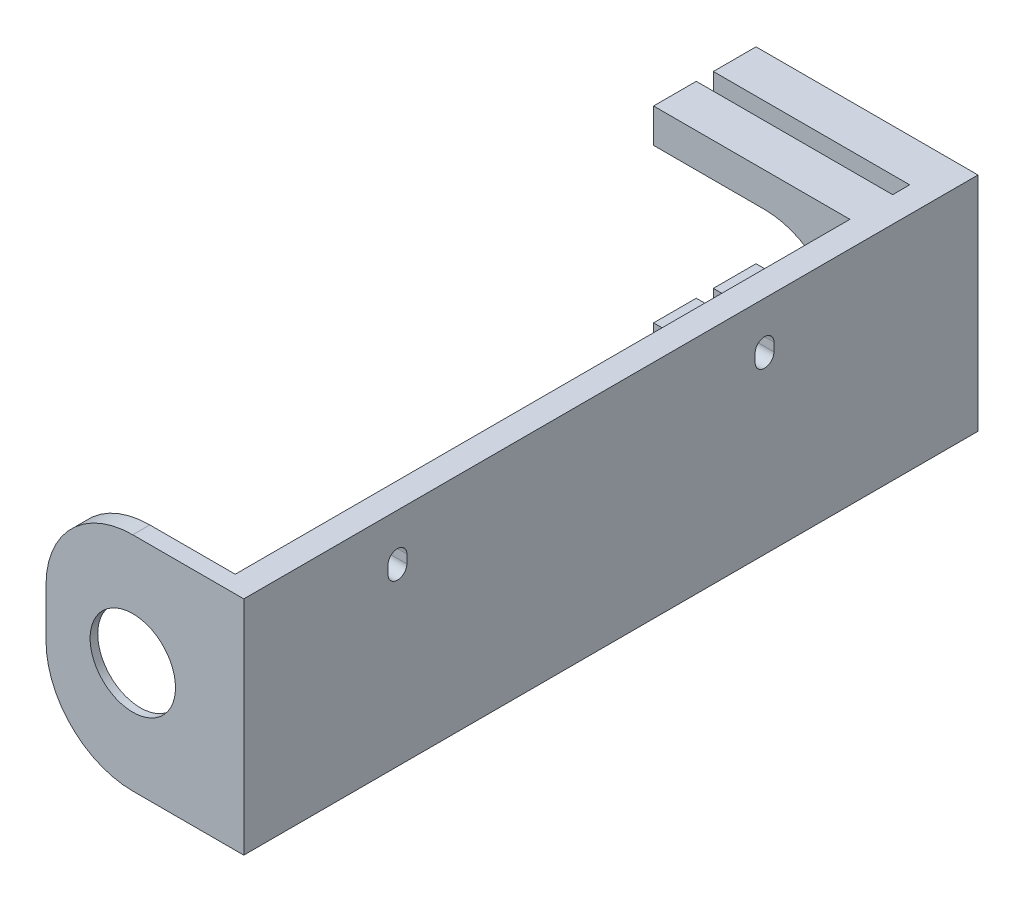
ISO-10303-21;
HEADER;
FILE_DESCRIPTION(('STEP AP214'),'2;1');
FILE_NAME('part.step','',(''),(''),'','','');
FILE_SCHEMA(('AUTOMOTIVE_DESIGN { 1 0 10303 214 1 1 1 1 }'));
ENDSEC;
DATA;
#1=APPLICATION_CONTEXT('core data for automotive mechanical design processes');
#2=APPLICATION_PROTOCOL_DEFINITION('international standard','automotive_design',2000,#1);
#3=PRODUCT_CONTEXT('',#1,'mechanical');
#4=PRODUCT('Part','Part','',(#3));
#5=PRODUCT_RELATED_PRODUCT_CATEGORY('part','',(#4));
#6=PRODUCT_DEFINITION_FORMATION('','',#4);
#7=PRODUCT_DEFINITION_CONTEXT('part definition',#1,'design');
#8=PRODUCT_DEFINITION('design','',#6,#7);
#9=PRODUCT_DEFINITION_SHAPE('','',#8);
#10=(LENGTH_UNIT() NAMED_UNIT(*) SI_UNIT(.MILLI.,.METRE.));
#11=(NAMED_UNIT(*) PLANE_ANGLE_UNIT() SI_UNIT($,.RADIAN.));
#12=(NAMED_UNIT(*) SI_UNIT($,.STERADIAN.) SOLID_ANGLE_UNIT());
#13=UNCERTAINTY_MEASURE_WITH_UNIT(LENGTH_MEASURE(1.E-05),#10,'distance_accuracy_value','');
#14=(GEOMETRIC_REPRESENTATION_CONTEXT(3) GLOBAL_UNCERTAINTY_ASSIGNED_CONTEXT((#13)) GLOBAL_UNIT_ASSIGNED_CONTEXT((#10,
#11,#12)) REPRESENTATION_CONTEXT('',''));
#15=CARTESIAN_POINT('',(0.,0.,0.));
#16=DIRECTION('',(0.,0.,1.));
#17=DIRECTION('',(1.,0.,0.));
#18=AXIS2_PLACEMENT_3D('',#15,#16,#17);
#19=CARTESIAN_POINT('',(-82.9442712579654,5.84291339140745,37.0413012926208));
#20=DIRECTION('',(-1.,0.,0.));
#21=DIRECTION('',(0.,0.,1.));
#22=AXIS2_PLACEMENT_3D('',#19,#20,#21);
#23=PLANE('',#22);
#24=DIRECTION('',(0.,1.,0.));
#25=VECTOR('',#24,1.);
#26=CARTESIAN_POINT('',(-82.9442712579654,5.84291339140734,74.0413012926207));
#27=LINE('',#26,#25);
#28=CARTESIAN_POINT('',(-82.9442712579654,2.84291339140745,74.0413012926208));
#29=VERTEX_POINT('',#28);
#30=CARTESIAN_POINT('',(-82.9442712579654,28.8429133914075,74.0413012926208));
#31=VERTEX_POINT('',#30);
#32=EDGE_CURVE('E480',#29,#31,#27,.T.);
#33=ORIENTED_EDGE('',*,*,#32,.T.);
#34=DIRECTION('',(0.,0.,-1.));
#35=VECTOR('',#34,1.);
#36=CARTESIAN_POINT('',(-82.9442712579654,28.8429133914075,-17.9814142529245));
#37=LINE('',#36,#35);
#38=CARTESIAN_POINT('',(-82.9442712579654,28.8429133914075,2.04130129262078));
#39=VERTEX_POINT('',#38);
#40=EDGE_CURVE('E461',#31,#39,#37,.T.);
#41=ORIENTED_EDGE('',*,*,#40,.T.);
#42=DIRECTION('',(0.,1.,0.));
#43=VECTOR('',#42,1.);
#44=CARTESIAN_POINT('',(-82.9442712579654,2.84291339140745,2.04130129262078));
#45=LINE('',#44,#43);
#46=CARTESIAN_POINT('',(-82.9442712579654,2.84291339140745,2.04130129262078));
#47=VERTEX_POINT('',#46);
#48=EDGE_CURVE('E254',#47,#39,#45,.T.);
#49=ORIENTED_EDGE('',*,*,#48,.F.);
#50=DIRECTION('',(0.,0.,-1.));
#51=VECTOR('',#50,1.);
#52=CARTESIAN_POINT('',(-82.9442712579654,2.84291339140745,74.0413012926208));
#53=LINE('',#52,#51);
#54=EDGE_CURVE('E474',#29,#47,#53,.T.);
#55=ORIENTED_EDGE('',*,*,#54,.F.);
#56=EDGE_LOOP('',(#33,#41,#49,#55));
#57=FACE_BOUND('',#56,.T.);
#58=DIRECTION('',(0.,1.,0.));
#59=VECTOR('',#58,1.);
#60=CARTESIAN_POINT('',(-82.9442712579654,5.84291339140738,59.1413012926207));
#61=LINE('',#60,#59);
#62=CARTESIAN_POINT('',(-82.9442712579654,22.8429133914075,59.1413012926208));
#63=VERTEX_POINT('',#62);
#64=CARTESIAN_POINT('',(-82.9442712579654,23.8429133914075,59.1413012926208));
#65=VERTEX_POINT('',#64);
#66=EDGE_CURVE('E562',#63,#65,#61,.T.);
#67=ORIENTED_EDGE('',*,*,#66,.F.);
#68=CARTESIAN_POINT('',(-82.9442712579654,22.8429133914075,58.0413012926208));
#69=DIRECTION('',(-1.,0.,0.));
#70=DIRECTION('',(0.,0.,1.));
#71=AXIS2_PLACEMENT_3D('',#68,#69,#70);
#72=CIRCLE('',#71,1.1);
#73=CARTESIAN_POINT('',(-82.9442712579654,22.8429133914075,56.9413012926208));
#74=VERTEX_POINT('',#73);
#75=EDGE_CURVE('E552',#74,#63,#72,.T.);
#76=ORIENTED_EDGE('',*,*,#75,.F.);
#77=DIRECTION('',(0.,1.,0.));
#78=VECTOR('',#77,1.);
#79=CARTESIAN_POINT('',(-82.9442712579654,5.84291339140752,56.9413012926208));
#80=LINE('',#79,#78);
#81=CARTESIAN_POINT('',(-82.9442712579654,23.8429133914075,56.9413012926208));
#82=VERTEX_POINT('',#81);
#83=EDGE_CURVE('E555',#74,#82,#80,.T.);
#84=ORIENTED_EDGE('',*,*,#83,.T.);
#85=CARTESIAN_POINT('',(-82.9442712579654,23.8429133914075,58.0413012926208));
#86=DIRECTION('',(-1.,0.,0.));
#87=DIRECTION('',(0.,0.,1.));
#88=AXIS2_PLACEMENT_3D('',#85,#86,#87);
#89=CIRCLE('',#88,1.1);
#90=EDGE_CURVE('E559',#65,#82,#89,.T.);
#91=ORIENTED_EDGE('',*,*,#90,.F.);
#92=EDGE_LOOP('',(#67,#76,#84,#91));
#93=FACE_BOUND('',#92,.T.);
#94=DIRECTION('',(0.,1.,0.));
#95=VECTOR('',#94,1.);
#96=CARTESIAN_POINT('',(-82.9442712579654,5.84291339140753,16.1413012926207));
#97=LINE('',#96,#95);
#98=CARTESIAN_POINT('',(-82.9442712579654,22.8429133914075,16.1413012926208));
#99=VERTEX_POINT('',#98);
#100=CARTESIAN_POINT('',(-82.9442712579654,23.8429133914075,16.1413012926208));
#101=VERTEX_POINT('',#100);
#102=EDGE_CURVE('E545',#99,#101,#97,.T.);
#103=ORIENTED_EDGE('',*,*,#102,.F.);
#104=CARTESIAN_POINT('',(-82.9442712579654,22.8429133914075,15.0413012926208));
#105=DIRECTION('',(-1.,0.,0.));
#106=DIRECTION('',(0.,0.,1.));
#107=AXIS2_PLACEMENT_3D('',#104,#105,#106);
#108=CIRCLE('',#107,1.1);
#109=CARTESIAN_POINT('',(-82.9442712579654,22.8429133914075,13.9413012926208));
#110=VERTEX_POINT('',#109);
#111=EDGE_CURVE('E548',#99,#110,#108,.F.);
#112=ORIENTED_EDGE('',*,*,#111,.T.);
#113=DIRECTION('',(0.,1.,0.));
#114=VECTOR('',#113,1.);
#115=CARTESIAN_POINT('',(-82.9442712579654,5.84291339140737,13.9413012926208));
#116=LINE('',#115,#114);
#117=CARTESIAN_POINT('',(-82.9442712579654,23.8429133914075,13.9413012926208));
#118=VERTEX_POINT('',#117);
#119=EDGE_CURVE('E503',#110,#118,#116,.T.);
#120=ORIENTED_EDGE('',*,*,#119,.T.);
#121=CARTESIAN_POINT('',(-82.9442712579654,23.8429133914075,15.0413012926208));
#122=DIRECTION('',(-1.,0.,0.));
#123=DIRECTION('',(0.,0.,1.));
#124=AXIS2_PLACEMENT_3D('',#121,#122,#123);
#125=CIRCLE('',#124,1.1);
#126=EDGE_CURVE('E541',#118,#101,#125,.F.);
#127=ORIENTED_EDGE('',*,*,#126,.T.);
#128=EDGE_LOOP('',(#103,#112,#120,#127));
#129=FACE_BOUND('',#128,.T.);
#130=ADVANCED_FACE('F43',(#57,#93,#129),#23,.T.);
#131=CARTESIAN_POINT('',(-79.9442712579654,5.84291339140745,37.0413012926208));
#132=DIRECTION('',(-1.,0.,0.));
#133=DIRECTION('',(0.,0.,1.));
#134=AXIS2_PLACEMENT_3D('',#131,#132,#133);
#135=PLANE('',#134);
#136=CARTESIAN_POINT('',(-79.9442712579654,22.8429133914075,58.0413012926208));
#137=DIRECTION('',(1.,0.,0.));
#138=DIRECTION('',(0.,0.,-1.));
#139=AXIS2_PLACEMENT_3D('',#136,#137,#138);
#140=CIRCLE('',#139,1.1);
#141=CARTESIAN_POINT('',(-79.9442712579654,22.8429133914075,59.1413012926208));
#142=VERTEX_POINT('',#141);
#143=CARTESIAN_POINT('',(-79.9442712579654,22.8429133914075,56.9413012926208));
#144=VERTEX_POINT('',#143);
#145=EDGE_CURVE('E487',#142,#144,#140,.T.);
#146=ORIENTED_EDGE('',*,*,#145,.F.);
#147=DIRECTION('',(0.,-1.,0.));
#148=VECTOR('',#147,1.);
#149=CARTESIAN_POINT('',(-79.9442712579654,5.84291339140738,59.1413012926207));
#150=LINE('',#149,#148);
#151=CARTESIAN_POINT('',(-79.9442712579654,23.8429133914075,59.1413012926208));
#152=VERTEX_POINT('',#151);
#153=EDGE_CURVE('E484',#152,#142,#150,.T.);
#154=ORIENTED_EDGE('',*,*,#153,.F.);
#155=CARTESIAN_POINT('',(-79.9442712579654,23.8429133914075,58.0413012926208));
#156=DIRECTION('',(1.,0.,0.));
#157=DIRECTION('',(0.,0.,-1.));
#158=AXIS2_PLACEMENT_3D('',#155,#156,#157);
#159=CIRCLE('',#158,1.1);
#160=CARTESIAN_POINT('',(-79.9442712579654,23.8429133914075,56.9413012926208));
#161=VERTEX_POINT('',#160);
#162=EDGE_CURVE('E495',#161,#152,#159,.T.);
#163=ORIENTED_EDGE('',*,*,#162,.F.);
#164=DIRECTION('',(0.,-1.,0.));
#165=VECTOR('',#164,1.);
#166=CARTESIAN_POINT('',(-79.9442712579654,5.84291339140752,56.9413012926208));
#167=LINE('',#166,#165);
#168=EDGE_CURVE('E491',#161,#144,#167,.T.);
#169=ORIENTED_EDGE('',*,*,#168,.T.);
#170=EDGE_LOOP('',(#146,#154,#163,#169));
#171=FACE_BOUND('',#170,.T.);
#172=DIRECTION('',(0.,0.,1.));
#173=VECTOR('',#172,1.);
#174=CARTESIAN_POINT('',(-79.9442712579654,2.84291339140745,-2.95869870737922));
#175=LINE('',#174,#173);
#176=CARTESIAN_POINT('',(-79.9442712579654,2.84291339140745,-9.95869870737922));
#177=VERTEX_POINT('',#176);
#178=CARTESIAN_POINT('',(-79.9442712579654,2.84291339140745,76.0413012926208));
#179=VERTEX_POINT('',#178);
#180=EDGE_CURVE('E477',#177,#179,#175,.T.);
#181=ORIENTED_EDGE('',*,*,#180,.F.);
#182=DIRECTION('',(0.,-1.,0.));
#183=VECTOR('',#182,1.);
#184=CARTESIAN_POINT('',(-79.9442712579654,25.8429133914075,-9.95869870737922));
#185=LINE('',#184,#183);
#186=CARTESIAN_POINT('',(-79.9442712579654,28.8429133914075,-9.95869870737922));
#187=VERTEX_POINT('',#186);
#188=EDGE_CURVE('E323',#187,#177,#185,.T.);
#189=ORIENTED_EDGE('',*,*,#188,.F.);
#190=DIRECTION('',(0.,0.,1.));
#191=VECTOR('',#190,1.);
#192=CARTESIAN_POINT('',(-79.9442712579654,28.8429133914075,-17.9814142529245));
#193=LINE('',#192,#191);
#194=CARTESIAN_POINT('',(-79.9442712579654,28.8429133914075,76.0413012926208));
#195=VERTEX_POINT('',#194);
#196=EDGE_CURVE('E439',#187,#195,#193,.T.);
#197=ORIENTED_EDGE('',*,*,#196,.T.);
#198=DIRECTION('',(0.,1.,0.));
#199=VECTOR('',#198,1.);
#200=CARTESIAN_POINT('',(-79.9442712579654,4.84291339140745,76.0413012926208));
#201=LINE('',#200,#199);
#202=EDGE_CURVE('E11',#179,#195,#201,.T.);
#203=ORIENTED_EDGE('',*,*,#202,.F.);
#204=EDGE_LOOP('',(#181,#189,#197,#203));
#205=FACE_BOUND('',#204,.T.);
#206=CARTESIAN_POINT('',(-79.9442712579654,22.8429133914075,15.0413012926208));
#207=DIRECTION('',(1.,0.,0.));
#208=DIRECTION('',(0.,0.,-1.));
#209=AXIS2_PLACEMENT_3D('',#206,#207,#208);
#210=CIRCLE('',#209,1.1);
#211=CARTESIAN_POINT('',(-79.9442712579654,22.8429133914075,13.9413012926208));
#212=VERTEX_POINT('',#211);
#213=CARTESIAN_POINT('',(-79.9442712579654,22.8429133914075,16.1413012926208));
#214=VERTEX_POINT('',#213);
#215=EDGE_CURVE('E488',#212,#214,#210,.F.);
#216=ORIENTED_EDGE('',*,*,#215,.T.);
#217=DIRECTION('',(0.,-1.,0.));
#218=VECTOR('',#217,1.);
#219=CARTESIAN_POINT('',(-79.9442712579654,5.84291339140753,16.1413012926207));
#220=LINE('',#219,#218);
#221=CARTESIAN_POINT('',(-79.9442712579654,23.8429133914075,16.1413012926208));
#222=VERTEX_POINT('',#221);
#223=EDGE_CURVE('E516',#222,#214,#220,.T.);
#224=ORIENTED_EDGE('',*,*,#223,.F.);
#225=CARTESIAN_POINT('',(-79.9442712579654,23.8429133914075,15.0413012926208));
#226=DIRECTION('',(1.,0.,0.));
#227=DIRECTION('',(0.,0.,-1.));
#228=AXIS2_PLACEMENT_3D('',#225,#226,#227);
#229=CIRCLE('',#228,1.1);
#230=CARTESIAN_POINT('',(-79.9442712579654,23.8429133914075,13.9413012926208));
#231=VERTEX_POINT('',#230);
#232=EDGE_CURVE('E527',#222,#231,#229,.F.);
#233=ORIENTED_EDGE('',*,*,#232,.T.);
#234=DIRECTION('',(0.,-1.,0.));
#235=VECTOR('',#234,1.);
#236=CARTESIAN_POINT('',(-79.9442712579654,5.84291339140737,13.9413012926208));
#237=LINE('',#236,#235);
#238=EDGE_CURVE('E531',#231,#212,#237,.T.);
#239=ORIENTED_EDGE('',*,*,#238,.T.);
#240=EDGE_LOOP('',(#216,#224,#233,#239));
#241=FACE_BOUND('',#240,.T.);
#242=ADVANCED_FACE('F577',(#171,#205,#241),#135,.F.);
#243=CARTESIAN_POINT('',(-92.9442712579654,15.8429133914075,75.264169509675));
#244=DIRECTION('',(0.,0.,-1.));
#245=DIRECTION('',(-1.,0.,0.));
#246=AXIS2_PLACEMENT_3D('',#243,#244,#245);
#247=CONICAL_SURFACE('',#246,4.7,1.20102779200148);
#248=CARTESIAN_POINT('',(-92.9442712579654,15.8429133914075,75.1478904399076));
#249=DIRECTION('',(0.,0.,-1.));
#250=DIRECTION('',(-1.,0.,0.));
#251=AXIS2_PLACEMENT_3D('',#248,#249,#250);
#252=CIRCLE('',#251,5.);
#253=CARTESIAN_POINT('',(-97.9442712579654,15.8429133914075,75.1478904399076));
#254=VERTEX_POINT('',#253);
#255=EDGE_CURVE('E565',#254,#254,#252,.F.);
#256=ORIENTED_EDGE('',*,*,#255,.T.);
#257=EDGE_LOOP('',(#256));
#258=FACE_BOUND('',#257,.T.);
#259=CARTESIAN_POINT('',(-92.9442712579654,15.8429133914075,74.0413012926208));
#260=DIRECTION('',(0.,0.,-1.));
#261=DIRECTION('',(0.,1.,0.));
#262=AXIS2_PLACEMENT_3D('',#259,#260,#261);
#263=CIRCLE('',#262,7.85499999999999);
#264=CARTESIAN_POINT('',(-92.9442712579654,23.6979133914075,74.0413012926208));
#265=VERTEX_POINT('',#264);
#266=EDGE_CURVE('E53',#265,#265,#263,.F.);
#267=ORIENTED_EDGE('',*,*,#266,.F.);
#268=EDGE_LOOP('',(#267));
#269=FACE_BOUND('',#268,.T.);
#270=ADVANCED_FACE('F575',(#258,#269),#247,.F.);
#271=CARTESIAN_POINT('',(-82.9442712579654,5.84291339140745,76.0413012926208));
#272=DIRECTION('',(0.,0.,1.));
#273=DIRECTION('',(1.,0.,0.));
#274=AXIS2_PLACEMENT_3D('',#271,#272,#273);
#275=PLANE('',#274);
#276=CARTESIAN_POINT('',(-92.9442712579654,15.8429133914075,76.0413012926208));
#277=DIRECTION('',(0.,0.,1.));
#278=DIRECTION('',(1.,0.,0.));
#279=AXIS2_PLACEMENT_3D('',#276,#277,#278);
#280=CIRCLE('',#279,5.);
#281=CARTESIAN_POINT('',(-87.9442712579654,15.8429133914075,76.0413012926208));
#282=VERTEX_POINT('',#281);
#283=EDGE_CURVE('E47',#282,#282,#280,.T.);
#284=ORIENTED_EDGE('',*,*,#283,.F.);
#285=EDGE_LOOP('',(#284));
#286=FACE_BOUND('',#285,.T.);
#287=CARTESIAN_POINT('',(-92.9442712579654,13.0095800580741,76.0413012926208));
#288=DIRECTION('',(0.,0.,1.));
#289=DIRECTION('',(1.,0.,0.));
#290=AXIS2_PLACEMENT_3D('',#287,#288,#289);
#291=CIRCLE('',#290,10.1666666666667);
#292=CARTESIAN_POINT('',(-92.9442712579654,2.84291339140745,76.0413012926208));
#293=VERTEX_POINT('',#292);
#294=CARTESIAN_POINT('',(-103.110937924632,13.0095800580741,76.0413012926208));
#295=VERTEX_POINT('',#294);
#296=EDGE_CURVE('E417',#293,#295,#291,.F.);
#297=ORIENTED_EDGE('',*,*,#296,.F.);
#298=DIRECTION('',(-1.,0.,0.));
#299=VECTOR('',#298,1.);
#300=CARTESIAN_POINT('',(-79.9442712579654,2.84291339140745,76.0413012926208));
#301=LINE('',#300,#299);
#302=EDGE_CURVE('E464',#179,#293,#301,.T.);
#303=ORIENTED_EDGE('',*,*,#302,.F.);
#304=ORIENTED_EDGE('',*,*,#202,.T.);
#305=DIRECTION('',(-1.,0.,0.));
#306=VECTOR('',#305,1.);
#307=CARTESIAN_POINT('',(-82.9442712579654,28.8429133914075,76.0413012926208));
#308=LINE('',#307,#306);
#309=CARTESIAN_POINT('',(-92.9442712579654,28.8429133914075,76.0413012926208));
#310=VERTEX_POINT('',#309);
#311=EDGE_CURVE('E449',#195,#310,#308,.T.);
#312=ORIENTED_EDGE('',*,*,#311,.T.);
#313=CARTESIAN_POINT('',(-92.9442712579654,18.6762467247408,76.0413012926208));
#314=DIRECTION('',(0.,0.,1.));
#315=DIRECTION('',(1.,0.,0.));
#316=AXIS2_PLACEMENT_3D('',#313,#314,#315);
#317=CIRCLE('',#316,10.1666666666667);
#318=CARTESIAN_POINT('',(-103.110937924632,18.6762467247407,76.0413012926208));
#319=VERTEX_POINT('',#318);
#320=EDGE_CURVE('E424',#310,#319,#317,.T.);
#321=ORIENTED_EDGE('',*,*,#320,.T.);
#322=DIRECTION('',(0.,1.,0.));
#323=VECTOR('',#322,1.);
#324=CARTESIAN_POINT('',(-103.110937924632,5.84291339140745,76.0413012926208));
#325=LINE('',#324,#323);
#326=EDGE_CURVE('E418',#295,#319,#325,.T.);
#327=ORIENTED_EDGE('',*,*,#326,.F.);
#328=EDGE_LOOP('',(#297,#303,#304,#312,#321,#327));
#329=FACE_BOUND('',#328,.T.);
#330=ADVANCED_FACE('F45',(#286,#329),#275,.T.);
#331=CARTESIAN_POINT('',(-92.9442712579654,15.8429133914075,74.0413012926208));
#332=DIRECTION('',(0.,0.,-1.));
#333=DIRECTION('',(0.,1.,0.));
#334=AXIS2_PLACEMENT_3D('',#331,#332,#333);
#335=PLANE('',#334);
#336=ORIENTED_EDGE('',*,*,#266,.T.);
#337=EDGE_LOOP('',(#336));
#338=FACE_BOUND('',#337,.T.);
#339=DIRECTION('',(1.,0.,0.));
#340=VECTOR('',#339,1.);
#341=CARTESIAN_POINT('',(-92.9442712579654,2.84291339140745,74.0413012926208));
#342=LINE('',#341,#340);
#343=CARTESIAN_POINT('',(-92.9442712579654,2.84291339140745,74.0413012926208));
#344=VERTEX_POINT('',#343);
#345=EDGE_CURVE('E470',#344,#29,#342,.T.);
#346=ORIENTED_EDGE('',*,*,#345,.F.);
#347=CARTESIAN_POINT('',(-92.9442712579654,13.0095800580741,74.0413012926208));
#348=DIRECTION('',(0.,0.,-1.));
#349=DIRECTION('',(0.,1.,0.));
#350=AXIS2_PLACEMENT_3D('',#347,#348,#349);
#351=CIRCLE('',#350,10.1666666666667);
#352=CARTESIAN_POINT('',(-103.110937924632,13.0095800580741,74.0413012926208));
#353=VERTEX_POINT('',#352);
#354=EDGE_CURVE('E428',#344,#353,#351,.T.);
#355=ORIENTED_EDGE('',*,*,#354,.T.);
#356=DIRECTION('',(0.,1.,0.));
#357=VECTOR('',#356,1.);
#358=CARTESIAN_POINT('',(-103.110937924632,5.84291339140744,74.0413012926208));
#359=LINE('',#358,#357);
#360=CARTESIAN_POINT('',(-103.110937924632,18.6762467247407,74.0413012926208));
#361=VERTEX_POINT('',#360);
#362=EDGE_CURVE('E435',#353,#361,#359,.T.);
#363=ORIENTED_EDGE('',*,*,#362,.T.);
#364=CARTESIAN_POINT('',(-92.9442712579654,18.6762467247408,74.0413012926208));
#365=DIRECTION('',(0.,0.,-1.));
#366=DIRECTION('',(0.,1.,0.));
#367=AXIS2_PLACEMENT_3D('',#364,#365,#366);
#368=CIRCLE('',#367,10.1666666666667);
#369=CARTESIAN_POINT('',(-92.9442712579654,28.8429133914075,74.0413012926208));
#370=VERTEX_POINT('',#369);
#371=EDGE_CURVE('E422',#370,#361,#368,.F.);
#372=ORIENTED_EDGE('',*,*,#371,.F.);
#373=DIRECTION('',(1.,0.,0.));
#374=VECTOR('',#373,1.);
#375=CARTESIAN_POINT('',(-82.9442712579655,28.8429133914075,74.0413012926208));
#376=LINE('',#375,#374);
#377=EDGE_CURVE('E457',#370,#31,#376,.T.);
#378=ORIENTED_EDGE('',*,*,#377,.T.);
#379=ORIENTED_EDGE('',*,*,#32,.F.);
#380=EDGE_LOOP('',(#346,#355,#363,#372,#378,#379));
#381=FACE_BOUND('',#380,.T.);
#382=ADVANCED_FACE('F572',(#338,#381),#335,.T.);
#383=CARTESIAN_POINT('',(-92.9442712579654,15.8429133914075,97.0413012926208));
#384=DIRECTION('',(0.,0.,-1.));
#385=DIRECTION('',(0.,1.,0.));
#386=AXIS2_PLACEMENT_3D('',#383,#384,#385);
#387=CYLINDRICAL_SURFACE('',#386,5.);
#388=ORIENTED_EDGE('',*,*,#283,.T.);
#389=EDGE_LOOP('',(#388));
#390=FACE_BOUND('',#389,.T.);
#391=ORIENTED_EDGE('',*,*,#255,.F.);
#392=EDGE_LOOP('',(#391));
#393=FACE_BOUND('',#392,.T.);
#394=ADVANCED_FACE('F595',(#390,#393),#387,.F.);
#395=CARTESIAN_POINT('',(-89.9442712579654,22.8429133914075,15.0413012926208));
#396=DIRECTION('',(1.,0.,0.));
#397=DIRECTION('',(0.,0.,-1.));
#398=AXIS2_PLACEMENT_3D('',#395,#396,#397);
#399=CYLINDRICAL_SURFACE('',#398,1.1);
#400=DIRECTION('',(1.,0.,0.));
#401=VECTOR('',#400,1.);
#402=CARTESIAN_POINT('',(-89.9442712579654,22.8429133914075,16.1413012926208));
#403=LINE('',#402,#401);
#404=EDGE_CURVE('E483',#99,#214,#403,.T.);
#405=ORIENTED_EDGE('',*,*,#404,.T.);
#406=ORIENTED_EDGE('',*,*,#215,.F.);
#407=DIRECTION('',(1.,0.,0.));
#408=VECTOR('',#407,1.);
#409=CARTESIAN_POINT('',(-89.9442712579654,22.8429133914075,13.9413012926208));
#410=LINE('',#409,#408);
#411=EDGE_CURVE('E512',#110,#212,#410,.T.);
#412=ORIENTED_EDGE('',*,*,#411,.F.);
#413=ORIENTED_EDGE('',*,*,#111,.F.);
#414=EDGE_LOOP('',(#405,#406,#412,#413));
#415=FACE_BOUND('',#414,.T.);
#416=ADVANCED_FACE('F598',(#415),#399,.F.);
#417=CARTESIAN_POINT('',(-89.9442712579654,5.84291339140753,16.1413012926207));
#418=DIRECTION('',(0.,0.,1.));
#419=DIRECTION('',(0.,-1.,0.));
#420=AXIS2_PLACEMENT_3D('',#417,#418,#419);
#421=PLANE('',#420);
#422=ORIENTED_EDGE('',*,*,#102,.T.);
#423=DIRECTION('',(1.,0.,0.));
#424=VECTOR('',#423,1.);
#425=CARTESIAN_POINT('',(-89.9442712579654,23.8429133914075,16.1413012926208));
#426=LINE('',#425,#424);
#427=EDGE_CURVE('E519',#101,#222,#426,.T.);
#428=ORIENTED_EDGE('',*,*,#427,.T.);
#429=ORIENTED_EDGE('',*,*,#223,.T.);
#430=ORIENTED_EDGE('',*,*,#404,.F.);
#431=EDGE_LOOP('',(#422,#428,#429,#430));
#432=FACE_BOUND('',#431,.T.);
#433=ADVANCED_FACE('F600',(#432),#421,.F.);
#434=CARTESIAN_POINT('',(-89.9442712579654,23.8429133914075,15.0413012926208));
#435=DIRECTION('',(1.,0.,0.));
#436=DIRECTION('',(0.,0.,-1.));
#437=AXIS2_PLACEMENT_3D('',#434,#435,#436);
#438=CYLINDRICAL_SURFACE('',#437,1.1);
#439=DIRECTION('',(1.,0.,0.));
#440=VECTOR('',#439,1.);
#441=CARTESIAN_POINT('',(-89.9442712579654,23.8429133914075,13.9413012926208));
#442=LINE('',#441,#440);
#443=EDGE_CURVE('E69',#118,#231,#442,.T.);
#444=ORIENTED_EDGE('',*,*,#443,.T.);
#445=ORIENTED_EDGE('',*,*,#232,.F.);
#446=ORIENTED_EDGE('',*,*,#427,.F.);
#447=ORIENTED_EDGE('',*,*,#126,.F.);
#448=EDGE_LOOP('',(#444,#445,#446,#447));
#449=FACE_BOUND('',#448,.T.);
#450=ADVANCED_FACE('F603',(#449),#438,.F.);
#451=CARTESIAN_POINT('',(-89.9442712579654,5.84291339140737,13.9413012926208));
#452=DIRECTION('',(0.,0.,1.));
#453=DIRECTION('',(0.,-1.,0.));
#454=AXIS2_PLACEMENT_3D('',#451,#452,#453);
#455=PLANE('',#454);
#456=ORIENTED_EDGE('',*,*,#411,.T.);
#457=ORIENTED_EDGE('',*,*,#238,.F.);
#458=ORIENTED_EDGE('',*,*,#443,.F.);
#459=ORIENTED_EDGE('',*,*,#119,.F.);
#460=EDGE_LOOP('',(#456,#457,#458,#459));
#461=FACE_BOUND('',#460,.T.);
#462=ADVANCED_FACE('F607',(#461),#455,.T.);
#463=CARTESIAN_POINT('',(-89.9442712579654,5.84291339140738,59.1413012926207));
#464=DIRECTION('',(0.,0.,1.));
#465=DIRECTION('',(0.,-1.,0.));
#466=AXIS2_PLACEMENT_3D('',#463,#464,#465);
#467=PLANE('',#466);
#468=ORIENTED_EDGE('',*,*,#66,.T.);
#469=DIRECTION('',(1.,0.,0.));
#470=VECTOR('',#469,1.);
#471=CARTESIAN_POINT('',(-89.9442712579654,23.8429133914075,59.1413012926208));
#472=LINE('',#471,#470);
#473=EDGE_CURVE('E500',#65,#152,#472,.T.);
#474=ORIENTED_EDGE('',*,*,#473,.T.);
#475=ORIENTED_EDGE('',*,*,#153,.T.);
#476=DIRECTION('',(1.,0.,0.));
#477=VECTOR('',#476,1.);
#478=CARTESIAN_POINT('',(-89.9442712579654,22.8429133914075,59.1413012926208));
#479=LINE('',#478,#477);
#480=EDGE_CURVE('E499',#63,#142,#479,.T.);
#481=ORIENTED_EDGE('',*,*,#480,.F.);
#482=EDGE_LOOP('',(#468,#474,#475,#481));
#483=FACE_BOUND('',#482,.T.);
#484=ADVANCED_FACE('F611',(#483),#467,.F.);
#485=CARTESIAN_POINT('',(-89.9442712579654,23.8429133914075,58.0413012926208));
#486=DIRECTION('',(1.,0.,0.));
#487=DIRECTION('',(0.,0.,-1.));
#488=AXIS2_PLACEMENT_3D('',#485,#486,#487);
#489=CYLINDRICAL_SURFACE('',#488,1.1);
#490=ORIENTED_EDGE('',*,*,#90,.T.);
#491=DIRECTION('',(1.,0.,0.));
#492=VECTOR('',#491,1.);
#493=CARTESIAN_POINT('',(-89.9442712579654,23.8429133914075,56.9413012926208));
#494=LINE('',#493,#492);
#495=EDGE_CURVE('E504',#82,#161,#494,.T.);
#496=ORIENTED_EDGE('',*,*,#495,.T.);
#497=ORIENTED_EDGE('',*,*,#162,.T.);
#498=ORIENTED_EDGE('',*,*,#473,.F.);
#499=EDGE_LOOP('',(#490,#496,#497,#498));
#500=FACE_BOUND('',#499,.T.);
#501=ADVANCED_FACE('F617',(#500),#489,.F.);
#502=CARTESIAN_POINT('',(-89.9442712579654,5.84291339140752,56.9413012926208));
#503=DIRECTION('',(0.,0.,1.));
#504=DIRECTION('',(0.,-1.,0.));
#505=AXIS2_PLACEMENT_3D('',#502,#503,#504);
#506=PLANE('',#505);
#507=DIRECTION('',(1.,0.,0.));
#508=VECTOR('',#507,1.);
#509=CARTESIAN_POINT('',(-89.9442712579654,22.8429133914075,56.9413012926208));
#510=LINE('',#509,#508);
#511=EDGE_CURVE('E61',#74,#144,#510,.T.);
#512=ORIENTED_EDGE('',*,*,#511,.T.);
#513=ORIENTED_EDGE('',*,*,#168,.F.);
#514=ORIENTED_EDGE('',*,*,#495,.F.);
#515=ORIENTED_EDGE('',*,*,#83,.F.);
#516=EDGE_LOOP('',(#512,#513,#514,#515));
#517=FACE_BOUND('',#516,.T.);
#518=ADVANCED_FACE('F623',(#517),#506,.T.);
#519=CARTESIAN_POINT('',(-89.9442712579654,22.8429133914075,58.0413012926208));
#520=DIRECTION('',(1.,0.,0.));
#521=DIRECTION('',(0.,0.,-1.));
#522=AXIS2_PLACEMENT_3D('',#519,#520,#521);
#523=CYLINDRICAL_SURFACE('',#522,1.1);
#524=ORIENTED_EDGE('',*,*,#75,.T.);
#525=ORIENTED_EDGE('',*,*,#480,.T.);
#526=ORIENTED_EDGE('',*,*,#145,.T.);
#527=ORIENTED_EDGE('',*,*,#511,.F.);
#528=EDGE_LOOP('',(#524,#525,#526,#527));
#529=FACE_BOUND('',#528,.T.);
#530=ADVANCED_FACE('F619',(#529),#523,.F.);
#531=CARTESIAN_POINT('',(-82.9442712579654,2.84291339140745,37.0413012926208));
#532=DIRECTION('',(0.,-1.,0.));
#533=DIRECTION('',(0.,0.,-1.));
#534=AXIS2_PLACEMENT_3D('',#531,#532,#533);
#535=PLANE('',#534);
#536=ORIENTED_EDGE('',*,*,#54,.T.);
#537=DIRECTION('',(-1.,0.,0.));
#538=VECTOR('',#537,1.);
#539=CARTESIAN_POINT('',(-82.9442712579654,2.84291339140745,2.04130129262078));
#540=LINE('',#539,#538);
#541=CARTESIAN_POINT('',(-105.944271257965,2.84291339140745,2.04130129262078));
#542=VERTEX_POINT('',#541);
#543=EDGE_CURVE('E290',#47,#542,#540,.T.);
#544=ORIENTED_EDGE('',*,*,#543,.T.);
#545=DIRECTION('',(0.,0.,-1.));
#546=VECTOR('',#545,1.);
#547=CARTESIAN_POINT('',(-105.944271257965,2.84291339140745,2.04130129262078));
#548=LINE('',#547,#546);
#549=CARTESIAN_POINT('',(-105.944271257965,2.84291339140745,-2.95869870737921));
#550=VERTEX_POINT('',#549);
#551=EDGE_CURVE('E293',#542,#550,#548,.T.);
#552=ORIENTED_EDGE('',*,*,#551,.T.);
#553=DIRECTION('',(1.,0.,0.));
#554=VECTOR('',#553,1.);
#555=CARTESIAN_POINT('',(-105.944271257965,2.84291339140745,-2.95869870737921));
#556=LINE('',#555,#554);
#557=CARTESIAN_POINT('',(-82.9442712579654,2.84291339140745,-2.95869870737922));
#558=VERTEX_POINT('',#557);
#559=EDGE_CURVE('E297',#550,#558,#556,.T.);
#560=ORIENTED_EDGE('',*,*,#559,.T.);
#561=DIRECTION('',(0.,0.,-1.));
#562=VECTOR('',#561,1.);
#563=CARTESIAN_POINT('',(-82.9442712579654,2.84291339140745,-2.95869870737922));
#564=LINE('',#563,#562);
#565=CARTESIAN_POINT('',(-82.9442712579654,2.84291339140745,-4.95869870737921));
#566=VERTEX_POINT('',#565);
#567=EDGE_CURVE('E301',#558,#566,#564,.T.);
#568=ORIENTED_EDGE('',*,*,#567,.T.);
#569=DIRECTION('',(-1.,0.,0.));
#570=VECTOR('',#569,1.);
#571=CARTESIAN_POINT('',(-82.9442712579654,2.84291339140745,-4.95869870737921));
#572=LINE('',#571,#570);
#573=CARTESIAN_POINT('',(-105.944271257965,2.84291339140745,-4.95869870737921));
#574=VERTEX_POINT('',#573);
#575=EDGE_CURVE('E305',#566,#574,#572,.T.);
#576=ORIENTED_EDGE('',*,*,#575,.T.);
#577=DIRECTION('',(0.,0.,-1.));
#578=VECTOR('',#577,1.);
#579=CARTESIAN_POINT('',(-105.944271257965,2.84291339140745,-4.95869870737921));
#580=LINE('',#579,#578);
#581=CARTESIAN_POINT('',(-105.944271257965,2.84291339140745,-9.95869870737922));
#582=VERTEX_POINT('',#581);
#583=EDGE_CURVE('E309',#574,#582,#580,.T.);
#584=ORIENTED_EDGE('',*,*,#583,.T.);
#585=DIRECTION('',(1.,0.,0.));
#586=VECTOR('',#585,1.);
#587=CARTESIAN_POINT('',(-105.944271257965,2.84291339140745,-9.95869870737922));
#588=LINE('',#587,#586);
#589=EDGE_CURVE('E313',#582,#177,#588,.T.);
#590=ORIENTED_EDGE('',*,*,#589,.T.);
#591=ORIENTED_EDGE('',*,*,#180,.T.);
#592=ORIENTED_EDGE('',*,*,#302,.T.);
#593=DIRECTION('',(0.,0.,-1.));
#594=VECTOR('',#593,1.);
#595=CARTESIAN_POINT('',(-92.9442712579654,2.84291339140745,76.0413012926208));
#596=LINE('',#595,#594);
#597=EDGE_CURVE('E467',#293,#344,#596,.T.);
#598=ORIENTED_EDGE('',*,*,#597,.T.);
#599=ORIENTED_EDGE('',*,*,#345,.T.);
#600=EDGE_LOOP('',(#536,#544,#552,#560,#568,#576,#584,#590,#591,#592,#598,#599));
#601=FACE_BOUND('',#600,.T.);
#602=ADVANCED_FACE('F622',(#601),#535,.T.);
#603=CARTESIAN_POINT('',(-82.9442712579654,28.8429133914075,37.0413012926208));
#604=DIRECTION('',(0.,-1.,0.));
#605=DIRECTION('',(0.,0.,-1.));
#606=AXIS2_PLACEMENT_3D('',#603,#604,#605);
#607=PLANE('',#606);
#608=ORIENTED_EDGE('',*,*,#196,.F.);
#609=DIRECTION('',(1.,0.,0.));
#610=VECTOR('',#609,1.);
#611=CARTESIAN_POINT('',(-82.9442712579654,28.8429133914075,-9.95869870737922));
#612=LINE('',#611,#610);
#613=CARTESIAN_POINT('',(-105.944271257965,28.8429133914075,-9.95869870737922));
#614=VERTEX_POINT('',#613);
#615=EDGE_CURVE('E264',#614,#187,#612,.T.);
#616=ORIENTED_EDGE('',*,*,#615,.F.);
#617=DIRECTION('',(0.,0.,-1.));
#618=VECTOR('',#617,1.);
#619=CARTESIAN_POINT('',(-105.944271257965,28.8429133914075,-24.9814142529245));
#620=LINE('',#619,#618);
#621=CARTESIAN_POINT('',(-105.944271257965,28.8429133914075,-4.95869870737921));
#622=VERTEX_POINT('',#621);
#623=EDGE_CURVE('E248',#622,#614,#620,.T.);
#624=ORIENTED_EDGE('',*,*,#623,.F.);
#625=DIRECTION('',(-1.,0.,0.));
#626=VECTOR('',#625,1.);
#627=CARTESIAN_POINT('',(-82.9442712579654,28.8429133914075,-4.95869870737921));
#628=LINE('',#627,#626);
#629=CARTESIAN_POINT('',(-82.9442712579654,28.8429133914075,-4.95869870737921));
#630=VERTEX_POINT('',#629);
#631=EDGE_CURVE('E261',#630,#622,#628,.T.);
#632=ORIENTED_EDGE('',*,*,#631,.F.);
#633=DIRECTION('',(0.,0.,-1.));
#634=VECTOR('',#633,1.);
#635=CARTESIAN_POINT('',(-82.9442712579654,28.8429133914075,-24.9814142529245));
#636=LINE('',#635,#634);
#637=CARTESIAN_POINT('',(-82.9442712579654,28.8429133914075,-2.95869870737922));
#638=VERTEX_POINT('',#637);
#639=EDGE_CURVE('E287',#638,#630,#636,.T.);
#640=ORIENTED_EDGE('',*,*,#639,.F.);
#641=DIRECTION('',(1.,0.,0.));
#642=VECTOR('',#641,1.);
#643=CARTESIAN_POINT('',(-82.9442712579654,28.8429133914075,-2.95869870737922));
#644=LINE('',#643,#642);
#645=CARTESIAN_POINT('',(-105.944271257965,28.8429133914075,-2.95869870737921));
#646=VERTEX_POINT('',#645);
#647=EDGE_CURVE('E283',#646,#638,#644,.T.);
#648=ORIENTED_EDGE('',*,*,#647,.F.);
#649=DIRECTION('',(0.,0.,-1.));
#650=VECTOR('',#649,1.);
#651=CARTESIAN_POINT('',(-105.944271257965,28.8429133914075,-24.9814142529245));
#652=LINE('',#651,#650);
#653=CARTESIAN_POINT('',(-105.944271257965,28.8429133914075,2.04130129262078));
#654=VERTEX_POINT('',#653);
#655=EDGE_CURVE('E279',#654,#646,#652,.T.);
#656=ORIENTED_EDGE('',*,*,#655,.F.);
#657=DIRECTION('',(-1.,0.,0.));
#658=VECTOR('',#657,1.);
#659=CARTESIAN_POINT('',(-82.9442712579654,28.8429133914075,2.04130129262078));
#660=LINE('',#659,#658);
#661=EDGE_CURVE('E276',#39,#654,#660,.T.);
#662=ORIENTED_EDGE('',*,*,#661,.F.);
#663=ORIENTED_EDGE('',*,*,#40,.F.);
#664=ORIENTED_EDGE('',*,*,#377,.F.);
#665=DIRECTION('',(0.,0.,-1.));
#666=VECTOR('',#665,1.);
#667=CARTESIAN_POINT('',(-92.9442712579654,28.8429133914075,-17.9814142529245));
#668=LINE('',#667,#666);
#669=EDGE_CURVE('E453',#310,#370,#668,.T.);
#670=ORIENTED_EDGE('',*,*,#669,.F.);
#671=ORIENTED_EDGE('',*,*,#311,.F.);
#672=EDGE_LOOP('',(#608,#616,#624,#632,#640,#648,#656,#662,#663,#664,#670,#671));
#673=FACE_BOUND('',#672,.T.);
#674=ADVANCED_FACE('F259',(#673),#607,.F.);
#675=CARTESIAN_POINT('',(-92.9442712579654,13.0095800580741,46.1242614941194));
#676=DIRECTION('',(0.,0.,1.));
#677=DIRECTION('',(1.,0.,0.));
#678=AXIS2_PLACEMENT_3D('',#675,#676,#677);
#679=CYLINDRICAL_SURFACE('',#678,10.1666666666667);
#680=ORIENTED_EDGE('',*,*,#354,.F.);
#681=ORIENTED_EDGE('',*,*,#597,.F.);
#682=ORIENTED_EDGE('',*,*,#296,.T.);
#683=DIRECTION('',(0.,0.,1.));
#684=VECTOR('',#683,1.);
#685=CARTESIAN_POINT('',(-103.110937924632,13.0095800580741,46.1242614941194));
#686=LINE('',#685,#684);
#687=EDGE_CURVE('E423',#353,#295,#686,.T.);
#688=ORIENTED_EDGE('',*,*,#687,.F.);
#689=EDGE_LOOP('',(#680,#681,#682,#688));
#690=FACE_BOUND('',#689,.T.);
#691=ADVANCED_FACE('F635',(#690),#679,.T.);
#692=CARTESIAN_POINT('',(-103.110937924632,5.84291339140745,46.1242614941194));
#693=DIRECTION('',(1.,0.,0.));
#694=DIRECTION('',(0.,0.,-1.));
#695=AXIS2_PLACEMENT_3D('',#692,#693,#694);
#696=PLANE('',#695);
#697=ORIENTED_EDGE('',*,*,#362,.F.);
#698=ORIENTED_EDGE('',*,*,#687,.T.);
#699=ORIENTED_EDGE('',*,*,#326,.T.);
#700=DIRECTION('',(0.,0.,1.));
#701=VECTOR('',#700,1.);
#702=CARTESIAN_POINT('',(-103.110937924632,18.6762467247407,46.1242614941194));
#703=LINE('',#702,#701);
#704=EDGE_CURVE('E429',#361,#319,#703,.T.);
#705=ORIENTED_EDGE('',*,*,#704,.F.);
#706=EDGE_LOOP('',(#697,#698,#699,#705));
#707=FACE_BOUND('',#706,.T.);
#708=ADVANCED_FACE('F638',(#707),#696,.F.);
#709=CARTESIAN_POINT('',(-92.9442712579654,18.6762467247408,46.1242614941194));
#710=DIRECTION('',(0.,0.,1.));
#711=DIRECTION('',(1.,0.,0.));
#712=AXIS2_PLACEMENT_3D('',#709,#710,#711);
#713=CYLINDRICAL_SURFACE('',#712,10.1666666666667);
#714=ORIENTED_EDGE('',*,*,#669,.T.);
#715=ORIENTED_EDGE('',*,*,#371,.T.);
#716=ORIENTED_EDGE('',*,*,#704,.T.);
#717=ORIENTED_EDGE('',*,*,#320,.F.);
#718=EDGE_LOOP('',(#714,#715,#716,#717));
#719=FACE_BOUND('',#718,.T.);
#720=ADVANCED_FACE('F642',(#719),#713,.T.);
#721=CARTESIAN_POINT('',(-83.9442712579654,5.84291339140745,-4.95869870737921));
#722=DIRECTION('',(0.,0.,-1.));
#723=DIRECTION('',(0.,-1.,0.));
#724=AXIS2_PLACEMENT_3D('',#721,#722,#723);
#725=PLANE('',#724);
#726=CARTESIAN_POINT('',(-92.9442712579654,15.8429133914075,-4.95869870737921));
#727=DIRECTION('',(0.,0.,-1.));
#728=DIRECTION('',(0.,1.,0.));
#729=AXIS2_PLACEMENT_3D('',#726,#727,#728);
#730=CIRCLE('',#729,9.);
#731=CARTESIAN_POINT('',(-92.9442712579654,24.8429133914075,-4.95869870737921));
#732=VERTEX_POINT('',#731);
#733=CARTESIAN_POINT('',(-92.9442712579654,6.84291339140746,-4.95869870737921));
#734=VERTEX_POINT('',#733);
#735=EDGE_CURVE('E320',#732,#734,#730,.T.);
#736=ORIENTED_EDGE('',*,*,#735,.T.);
#737=DIRECTION('',(1.,0.,0.));
#738=VECTOR('',#737,1.);
#739=CARTESIAN_POINT('',(-83.9442712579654,6.84291339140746,-4.95869870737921));
#740=LINE('',#739,#738);
#741=CARTESIAN_POINT('',(-105.944271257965,6.84291339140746,-4.95869870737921));
#742=VERTEX_POINT('',#741);
#743=EDGE_CURVE('E324',#742,#734,#740,.T.);
#744=ORIENTED_EDGE('',*,*,#743,.F.);
#745=DIRECTION('',(0.,1.,0.));
#746=VECTOR('',#745,1.);
#747=CARTESIAN_POINT('',(-105.944271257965,4.84291339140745,-4.95869870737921));
#748=LINE('',#747,#746);
#749=EDGE_CURVE('E348',#574,#742,#748,.T.);
#750=ORIENTED_EDGE('',*,*,#749,.F.);
#751=ORIENTED_EDGE('',*,*,#575,.F.);
#752=DIRECTION('',(0.,-1.,0.));
#753=VECTOR('',#752,1.);
#754=CARTESIAN_POINT('',(-82.9442712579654,25.8429133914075,-4.95869870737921));
#755=LINE('',#754,#753);
#756=EDGE_CURVE('E270',#630,#566,#755,.T.);
#757=ORIENTED_EDGE('',*,*,#756,.F.);
#758=ORIENTED_EDGE('',*,*,#631,.T.);
#759=DIRECTION('',(0.,1.,0.));
#760=VECTOR('',#759,1.);
#761=CARTESIAN_POINT('',(-105.944271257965,24.8429133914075,-4.95869870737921));
#762=LINE('',#761,#760);
#763=CARTESIAN_POINT('',(-105.944271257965,24.8429133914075,-4.95869870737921));
#764=VERTEX_POINT('',#763);
#765=EDGE_CURVE('E244',#764,#622,#762,.T.);
#766=ORIENTED_EDGE('',*,*,#765,.F.);
#767=DIRECTION('',(1.,0.,0.));
#768=VECTOR('',#767,1.);
#769=CARTESIAN_POINT('',(-83.9442712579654,24.8429133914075,-4.95869870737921));
#770=LINE('',#769,#768);
#771=EDGE_CURVE('E317',#764,#732,#770,.T.);
#772=ORIENTED_EDGE('',*,*,#771,.T.);
#773=EDGE_LOOP('',(#736,#744,#750,#751,#757,#758,#766,#772));
#774=FACE_BOUND('',#773,.T.);
#775=ADVANCED_FACE('F268',(#774),#725,.F.);
#776=CARTESIAN_POINT('',(-104.944271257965,25.8429133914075,-9.95869870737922));
#777=DIRECTION('',(0.,0.,1.));
#778=DIRECTION('',(-1.,0.,0.));
#779=AXIS2_PLACEMENT_3D('',#776,#777,#778);
#780=PLANE('',#779);
#781=ORIENTED_EDGE('',*,*,#188,.T.);
#782=ORIENTED_EDGE('',*,*,#589,.F.);
#783=DIRECTION('',(0.,-1.,0.));
#784=VECTOR('',#783,1.);
#785=CARTESIAN_POINT('',(-105.944271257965,6.84291339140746,-9.95869870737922));
#786=LINE('',#785,#784);
#787=CARTESIAN_POINT('',(-105.944271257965,6.84291339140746,-9.95869870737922));
#788=VERTEX_POINT('',#787);
#789=EDGE_CURVE('E376',#788,#582,#786,.T.);
#790=ORIENTED_EDGE('',*,*,#789,.F.);
#791=DIRECTION('',(-1.,0.,0.));
#792=VECTOR('',#791,1.);
#793=CARTESIAN_POINT('',(-82.9442712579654,6.84291339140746,-9.95869870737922));
#794=LINE('',#793,#792);
#795=CARTESIAN_POINT('',(-92.9442712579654,6.84291339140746,-9.95869870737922));
#796=VERTEX_POINT('',#795);
#797=EDGE_CURVE('E327',#796,#788,#794,.T.);
#798=ORIENTED_EDGE('',*,*,#797,.F.);
#799=CARTESIAN_POINT('',(-92.9442712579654,15.8429133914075,-9.95869870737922));
#800=DIRECTION('',(0.,0.,1.));
#801=DIRECTION('',(1.,0.,0.));
#802=AXIS2_PLACEMENT_3D('',#799,#800,#801);
#803=CIRCLE('',#802,9.);
#804=CARTESIAN_POINT('',(-92.9442712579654,24.8429133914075,-9.95869870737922));
#805=VERTEX_POINT('',#804);
#806=EDGE_CURVE('E331',#796,#805,#803,.T.);
#807=ORIENTED_EDGE('',*,*,#806,.T.);
#808=DIRECTION('',(-1.,0.,0.));
#809=VECTOR('',#808,1.);
#810=CARTESIAN_POINT('',(-82.9442712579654,24.8429133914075,-9.95869870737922));
#811=LINE('',#810,#809);
#812=CARTESIAN_POINT('',(-105.944271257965,24.8429133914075,-9.95869870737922));
#813=VERTEX_POINT('',#812);
#814=EDGE_CURVE('E368',#805,#813,#811,.T.);
#815=ORIENTED_EDGE('',*,*,#814,.T.);
#816=DIRECTION('',(0.,-1.,0.));
#817=VECTOR('',#816,1.);
#818=CARTESIAN_POINT('',(-105.944271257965,26.8429133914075,-9.95869870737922));
#819=LINE('',#818,#817);
#820=EDGE_CURVE('E402',#614,#813,#819,.T.);
#821=ORIENTED_EDGE('',*,*,#820,.F.);
#822=ORIENTED_EDGE('',*,*,#615,.T.);
#823=EDGE_LOOP('',(#781,#782,#790,#798,#807,#815,#821,#822));
#824=FACE_BOUND('',#823,.T.);
#825=ADVANCED_FACE('F687',(#824),#780,.F.);
#826=CARTESIAN_POINT('',(-104.944271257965,25.8429133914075,2.04130129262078));
#827=DIRECTION('',(0.,0.,1.));
#828=DIRECTION('',(-1.,0.,0.));
#829=AXIS2_PLACEMENT_3D('',#826,#827,#828);
#830=PLANE('',#829);
#831=ORIENTED_EDGE('',*,*,#543,.F.);
#832=ORIENTED_EDGE('',*,*,#48,.T.);
#833=ORIENTED_EDGE('',*,*,#661,.T.);
#834=DIRECTION('',(0.,1.,0.));
#835=VECTOR('',#834,1.);
#836=CARTESIAN_POINT('',(-105.944271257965,24.8429133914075,2.04130129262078));
#837=LINE('',#836,#835);
#838=CARTESIAN_POINT('',(-105.944271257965,24.8429133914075,2.04130129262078));
#839=VERTEX_POINT('',#838);
#840=EDGE_CURVE('E398',#839,#654,#837,.T.);
#841=ORIENTED_EDGE('',*,*,#840,.F.);
#842=DIRECTION('',(-1.,0.,0.));
#843=VECTOR('',#842,1.);
#844=CARTESIAN_POINT('',(-82.9442712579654,24.8429133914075,2.04130129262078));
#845=LINE('',#844,#843);
#846=CARTESIAN_POINT('',(-92.9442712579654,24.8429133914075,2.04130129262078));
#847=VERTEX_POINT('',#846);
#848=EDGE_CURVE('E360',#847,#839,#845,.T.);
#849=ORIENTED_EDGE('',*,*,#848,.F.);
#850=CARTESIAN_POINT('',(-92.9442712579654,15.8429133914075,2.04130129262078));
#851=DIRECTION('',(0.,0.,1.));
#852=DIRECTION('',(1.,0.,0.));
#853=AXIS2_PLACEMENT_3D('',#850,#851,#852);
#854=CIRCLE('',#853,9.);
#855=CARTESIAN_POINT('',(-92.9442712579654,6.84291339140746,2.04130129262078));
#856=VERTEX_POINT('',#855);
#857=EDGE_CURVE('E349',#856,#847,#854,.T.);
#858=ORIENTED_EDGE('',*,*,#857,.F.);
#859=DIRECTION('',(-1.,0.,0.));
#860=VECTOR('',#859,1.);
#861=CARTESIAN_POINT('',(-82.9442712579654,6.84291339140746,2.04130129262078));
#862=LINE('',#861,#860);
#863=CARTESIAN_POINT('',(-105.944271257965,6.84291339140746,2.04130129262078));
#864=VERTEX_POINT('',#863);
#865=EDGE_CURVE('E344',#856,#864,#862,.T.);
#866=ORIENTED_EDGE('',*,*,#865,.T.);
#867=DIRECTION('',(0.,1.,0.));
#868=VECTOR('',#867,1.);
#869=CARTESIAN_POINT('',(-105.944271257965,4.84291339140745,2.04130129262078));
#870=LINE('',#869,#868);
#871=EDGE_CURVE('E379',#542,#864,#870,.T.);
#872=ORIENTED_EDGE('',*,*,#871,.F.);
#873=EDGE_LOOP('',(#831,#832,#833,#841,#849,#858,#866,#872));
#874=FACE_BOUND('',#873,.T.);
#875=ADVANCED_FACE('F683',(#874),#830,.T.);
#876=CARTESIAN_POINT('',(-83.9442712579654,5.84291339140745,-2.95869870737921));
#877=DIRECTION('',(0.,0.,1.));
#878=DIRECTION('',(0.,1.,0.));
#879=AXIS2_PLACEMENT_3D('',#876,#877,#878);
#880=PLANE('',#879);
#881=CARTESIAN_POINT('',(-92.9442712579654,15.8429133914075,-2.95869870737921));
#882=DIRECTION('',(0.,0.,1.));
#883=DIRECTION('',(0.,-1.,0.));
#884=AXIS2_PLACEMENT_3D('',#881,#882,#883);
#885=CIRCLE('',#884,9.);
#886=CARTESIAN_POINT('',(-92.9442712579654,6.84291339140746,-2.95869870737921));
#887=VERTEX_POINT('',#886);
#888=CARTESIAN_POINT('',(-92.9442712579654,24.8429133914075,-2.95869870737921));
#889=VERTEX_POINT('',#888);
#890=EDGE_CURVE('E340',#887,#889,#885,.T.);
#891=ORIENTED_EDGE('',*,*,#890,.T.);
#892=DIRECTION('',(-1.,0.,0.));
#893=VECTOR('',#892,1.);
#894=CARTESIAN_POINT('',(-83.9442712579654,24.8429133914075,-2.95869870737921));
#895=LINE('',#894,#893);
#896=CARTESIAN_POINT('',(-105.944271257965,24.8429133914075,-2.95869870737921));
#897=VERTEX_POINT('',#896);
#898=EDGE_CURVE('E337',#889,#897,#895,.T.);
#899=ORIENTED_EDGE('',*,*,#898,.T.);
#900=DIRECTION('',(0.,-1.,0.));
#901=VECTOR('',#900,1.);
#902=CARTESIAN_POINT('',(-105.944271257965,26.8429133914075,-2.95869870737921));
#903=LINE('',#902,#901);
#904=EDGE_CURVE('E390',#646,#897,#903,.T.);
#905=ORIENTED_EDGE('',*,*,#904,.F.);
#906=ORIENTED_EDGE('',*,*,#647,.T.);
#907=DIRECTION('',(0.,-1.,0.));
#908=VECTOR('',#907,1.);
#909=CARTESIAN_POINT('',(-82.9442712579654,25.8429133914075,-2.95869870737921));
#910=LINE('',#909,#908);
#911=EDGE_CURVE('E334',#638,#558,#910,.T.);
#912=ORIENTED_EDGE('',*,*,#911,.T.);
#913=ORIENTED_EDGE('',*,*,#559,.F.);
#914=DIRECTION('',(0.,-1.,0.));
#915=VECTOR('',#914,1.);
#916=CARTESIAN_POINT('',(-105.944271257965,6.84291339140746,-2.95869870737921));
#917=LINE('',#916,#915);
#918=CARTESIAN_POINT('',(-105.944271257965,6.84291339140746,-2.95869870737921));
#919=VERTEX_POINT('',#918);
#920=EDGE_CURVE('E387',#919,#550,#917,.T.);
#921=ORIENTED_EDGE('',*,*,#920,.F.);
#922=DIRECTION('',(-1.,0.,0.));
#923=VECTOR('',#922,1.);
#924=CARTESIAN_POINT('',(-83.9442712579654,6.84291339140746,-2.95869870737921));
#925=LINE('',#924,#923);
#926=EDGE_CURVE('E345',#887,#919,#925,.T.);
#927=ORIENTED_EDGE('',*,*,#926,.F.);
#928=EDGE_LOOP('',(#891,#899,#905,#906,#912,#913,#921,#927));
#929=FACE_BOUND('',#928,.T.);
#930=ADVANCED_FACE('F679',(#929),#880,.F.);
#931=CARTESIAN_POINT('',(-82.9442712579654,25.8429133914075,30.0413012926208));
#932=DIRECTION('',(-1.,0.,0.));
#933=DIRECTION('',(0.,0.,1.));
#934=AXIS2_PLACEMENT_3D('',#931,#932,#933);
#935=PLANE('',#934);
#936=ORIENTED_EDGE('',*,*,#756,.T.);
#937=ORIENTED_EDGE('',*,*,#567,.F.);
#938=ORIENTED_EDGE('',*,*,#911,.F.);
#939=ORIENTED_EDGE('',*,*,#639,.T.);
#940=EDGE_LOOP('',(#936,#937,#938,#939));
#941=FACE_BOUND('',#940,.T.);
#942=ADVANCED_FACE('F676',(#941),#935,.T.);
#943=CARTESIAN_POINT('',(-82.9442712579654,6.84291339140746,-9.95869870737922));
#944=DIRECTION('',(0.,1.,0.));
#945=DIRECTION('',(-1.,0.,0.));
#946=AXIS2_PLACEMENT_3D('',#943,#944,#945);
#947=PLANE('',#946);
#948=ORIENTED_EDGE('',*,*,#743,.T.);
#949=DIRECTION('',(0.,0.,1.));
#950=VECTOR('',#949,1.);
#951=CARTESIAN_POINT('',(-92.9442712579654,6.84291339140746,-9.95869870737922));
#952=LINE('',#951,#950);
#953=EDGE_CURVE('E350',#796,#734,#952,.T.);
#954=ORIENTED_EDGE('',*,*,#953,.F.);
#955=ORIENTED_EDGE('',*,*,#797,.T.);
#956=DIRECTION('',(0.,0.,-1.));
#957=VECTOR('',#956,1.);
#958=CARTESIAN_POINT('',(-105.944271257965,6.84291339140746,-4.95869870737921));
#959=LINE('',#958,#957);
#960=EDGE_CURVE('E380',#742,#788,#959,.T.);
#961=ORIENTED_EDGE('',*,*,#960,.F.);
#962=EDGE_LOOP('',(#948,#954,#955,#961));
#963=FACE_BOUND('',#962,.T.);
#964=ADVANCED_FACE('F675',(#963),#947,.T.);
#965=CARTESIAN_POINT('',(-92.9442712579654,15.8429133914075,-9.95869870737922));
#966=DIRECTION('',(0.,0.,1.));
#967=DIRECTION('',(1.,0.,0.));
#968=AXIS2_PLACEMENT_3D('',#965,#966,#967);
#969=CYLINDRICAL_SURFACE('',#968,9.);
#970=DIRECTION('',(0.,0.,1.));
#971=VECTOR('',#970,1.);
#972=CARTESIAN_POINT('',(-92.9442712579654,24.8429133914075,-9.95869870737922));
#973=LINE('',#972,#971);
#974=EDGE_CURVE('E354',#805,#732,#973,.T.);
#975=ORIENTED_EDGE('',*,*,#974,.F.);
#976=ORIENTED_EDGE('',*,*,#806,.F.);
#977=ORIENTED_EDGE('',*,*,#953,.T.);
#978=ORIENTED_EDGE('',*,*,#735,.F.);
#979=EDGE_LOOP('',(#975,#976,#977,#978));
#980=FACE_BOUND('',#979,.T.);
#981=ADVANCED_FACE('F671',(#980),#969,.F.);
#982=CARTESIAN_POINT('',(-82.9442712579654,24.8429133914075,-9.95869870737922));
#983=DIRECTION('',(0.,1.,0.));
#984=DIRECTION('',(0.,0.,1.));
#985=AXIS2_PLACEMENT_3D('',#982,#983,#984);
#986=PLANE('',#985);
#987=ORIENTED_EDGE('',*,*,#771,.F.);
#988=DIRECTION('',(0.,0.,1.));
#989=VECTOR('',#988,1.);
#990=CARTESIAN_POINT('',(-105.944271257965,24.8429133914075,-9.95869870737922));
#991=LINE('',#990,#989);
#992=EDGE_CURVE('E250',#813,#764,#991,.T.);
#993=ORIENTED_EDGE('',*,*,#992,.F.);
#994=ORIENTED_EDGE('',*,*,#814,.F.);
#995=ORIENTED_EDGE('',*,*,#974,.T.);
#996=EDGE_LOOP('',(#987,#993,#994,#995));
#997=FACE_BOUND('',#996,.T.);
#998=ADVANCED_FACE('F666',(#997),#986,.F.);
#999=EDGE_CURVE('E359',#889,#847,#973,.T.);
#1000=ORIENTED_EDGE('',*,*,#999,.T.);
#1001=ORIENTED_EDGE('',*,*,#848,.T.);
#1002=DIRECTION('',(0.,0.,1.));
#1003=VECTOR('',#1002,1.);
#1004=CARTESIAN_POINT('',(-105.944271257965,24.8429133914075,-2.95869870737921));
#1005=LINE('',#1004,#1003);
#1006=EDGE_CURVE('E403',#897,#839,#1005,.T.);
#1007=ORIENTED_EDGE('',*,*,#1006,.F.);
#1008=ORIENTED_EDGE('',*,*,#898,.F.);
#1009=EDGE_LOOP('',(#1000,#1001,#1007,#1008));
#1010=FACE_BOUND('',#1009,.T.);
#1011=ADVANCED_FACE('F662',(#1010),#986,.F.);
#1012=EDGE_CURVE('E355',#887,#856,#952,.T.);
#1013=ORIENTED_EDGE('',*,*,#1012,.T.);
#1014=ORIENTED_EDGE('',*,*,#857,.T.);
#1015=ORIENTED_EDGE('',*,*,#999,.F.);
#1016=ORIENTED_EDGE('',*,*,#890,.F.);
#1017=EDGE_LOOP('',(#1013,#1014,#1015,#1016));
#1018=FACE_BOUND('',#1017,.T.);
#1019=ADVANCED_FACE('F665',(#1018),#969,.F.);
#1020=ORIENTED_EDGE('',*,*,#926,.T.);
#1021=DIRECTION('',(0.,0.,-1.));
#1022=VECTOR('',#1021,1.);
#1023=CARTESIAN_POINT('',(-105.944271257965,6.84291339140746,2.04130129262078));
#1024=LINE('',#1023,#1022);
#1025=EDGE_CURVE('E391',#864,#919,#1024,.T.);
#1026=ORIENTED_EDGE('',*,*,#1025,.F.);
#1027=ORIENTED_EDGE('',*,*,#865,.F.);
#1028=ORIENTED_EDGE('',*,*,#1012,.F.);
#1029=EDGE_LOOP('',(#1020,#1026,#1027,#1028));
#1030=FACE_BOUND('',#1029,.T.);
#1031=ADVANCED_FACE('F660',(#1030),#947,.T.);
#1032=CARTESIAN_POINT('',(-105.944271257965,5.84291339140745,30.0413012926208));
#1033=DIRECTION('',(-1.,0.,0.));
#1034=DIRECTION('',(0.,0.,1.));
#1035=AXIS2_PLACEMENT_3D('',#1032,#1033,#1034);
#1036=PLANE('',#1035);
#1037=ORIENTED_EDGE('',*,*,#789,.T.);
#1038=ORIENTED_EDGE('',*,*,#583,.F.);
#1039=ORIENTED_EDGE('',*,*,#749,.T.);
#1040=ORIENTED_EDGE('',*,*,#960,.T.);
#1041=EDGE_LOOP('',(#1037,#1038,#1039,#1040));
#1042=FACE_BOUND('',#1041,.T.);
#1043=ADVANCED_FACE('F656',(#1042),#1036,.T.);
#1044=CARTESIAN_POINT('',(-105.944271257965,5.84291339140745,30.0413012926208));
#1045=DIRECTION('',(-1.,0.,0.));
#1046=DIRECTION('',(0.,0.,1.));
#1047=AXIS2_PLACEMENT_3D('',#1044,#1045,#1046);
#1048=PLANE('',#1047);
#1049=ORIENTED_EDGE('',*,*,#920,.T.);
#1050=ORIENTED_EDGE('',*,*,#551,.F.);
#1051=ORIENTED_EDGE('',*,*,#871,.T.);
#1052=ORIENTED_EDGE('',*,*,#1025,.T.);
#1053=EDGE_LOOP('',(#1049,#1050,#1051,#1052));
#1054=FACE_BOUND('',#1053,.T.);
#1055=ADVANCED_FACE('F652',(#1054),#1048,.T.);
#1056=CARTESIAN_POINT('',(-105.944271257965,5.84291339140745,30.0413012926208));
#1057=DIRECTION('',(-1.,0.,0.));
#1058=DIRECTION('',(0.,0.,1.));
#1059=AXIS2_PLACEMENT_3D('',#1056,#1057,#1058);
#1060=PLANE('',#1059);
#1061=ORIENTED_EDGE('',*,*,#904,.T.);
#1062=ORIENTED_EDGE('',*,*,#1006,.T.);
#1063=ORIENTED_EDGE('',*,*,#840,.T.);
#1064=ORIENTED_EDGE('',*,*,#655,.T.);
#1065=EDGE_LOOP('',(#1061,#1062,#1063,#1064));
#1066=FACE_BOUND('',#1065,.T.);
#1067=ADVANCED_FACE('F649',(#1066),#1060,.T.);
#1068=CARTESIAN_POINT('',(-105.944271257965,5.84291339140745,30.0413012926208));
#1069=DIRECTION('',(-1.,0.,0.));
#1070=DIRECTION('',(0.,0.,1.));
#1071=AXIS2_PLACEMENT_3D('',#1068,#1069,#1070);
#1072=PLANE('',#1071);
#1073=ORIENTED_EDGE('',*,*,#820,.T.);
#1074=ORIENTED_EDGE('',*,*,#992,.T.);
#1075=ORIENTED_EDGE('',*,*,#765,.T.);
#1076=ORIENTED_EDGE('',*,*,#623,.T.);
#1077=EDGE_LOOP('',(#1073,#1074,#1075,#1076));
#1078=FACE_BOUND('',#1077,.T.);
#1079=ADVANCED_FACE('F247',(#1078),#1072,.T.);
#1080=CLOSED_SHELL('',(#130,#242,#270,#330,#382,#394,#416,#433,#450,#462,#484,#501,#518,#530,
#602,#674,#691,#708,#720,#775,#825,#875,#930,#942,#964,#981,#998,#1011,#1019,#1031,#1043,#1055,
#1067,#1079));
#1081=MANIFOLD_SOLID_BREP('B2',#1080);
#1082=ADVANCED_BREP_SHAPE_REPRESENTATION('',(#18,#1081),#14);
#1083=SHAPE_DEFINITION_REPRESENTATION(#9,#1082);
ENDSEC;
END-ISO-10303-21;
